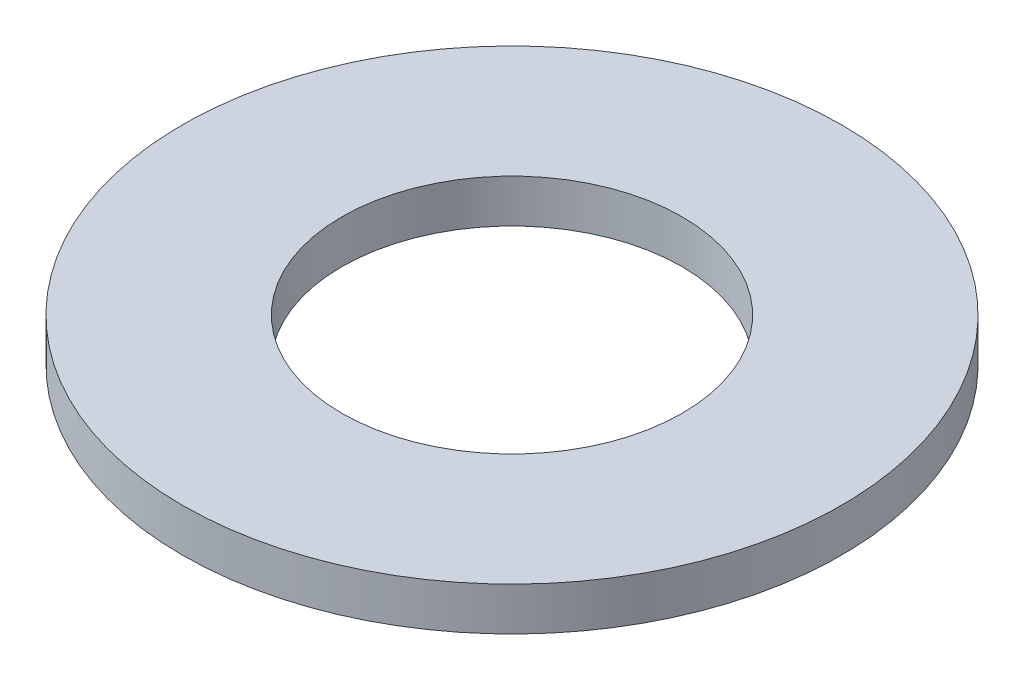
from build123d import *

# Parameters (mm, degrees)
ESQUISSE1_W = 29.5
ESQUISSE1_H = 8


with BuildPart() as part:
    # Esquisse1 → Base-R_volution (revolve)
    with BuildSketch(Plane.XY, mode=Mode.PRIVATE) as base_r_volution_sk:
        with Locations((-46.25, 4)):
            Rectangle(ESQUISSE1_W, ESQUISSE1_H)
    revolve(base_r_volution_sk.sketch.rotate(Axis((0, -3.831145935, 0), (0, 1, 0)), 270), axis=Axis((0, -3.831145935, 0), (0, 1, 0)))


solid = part.part
